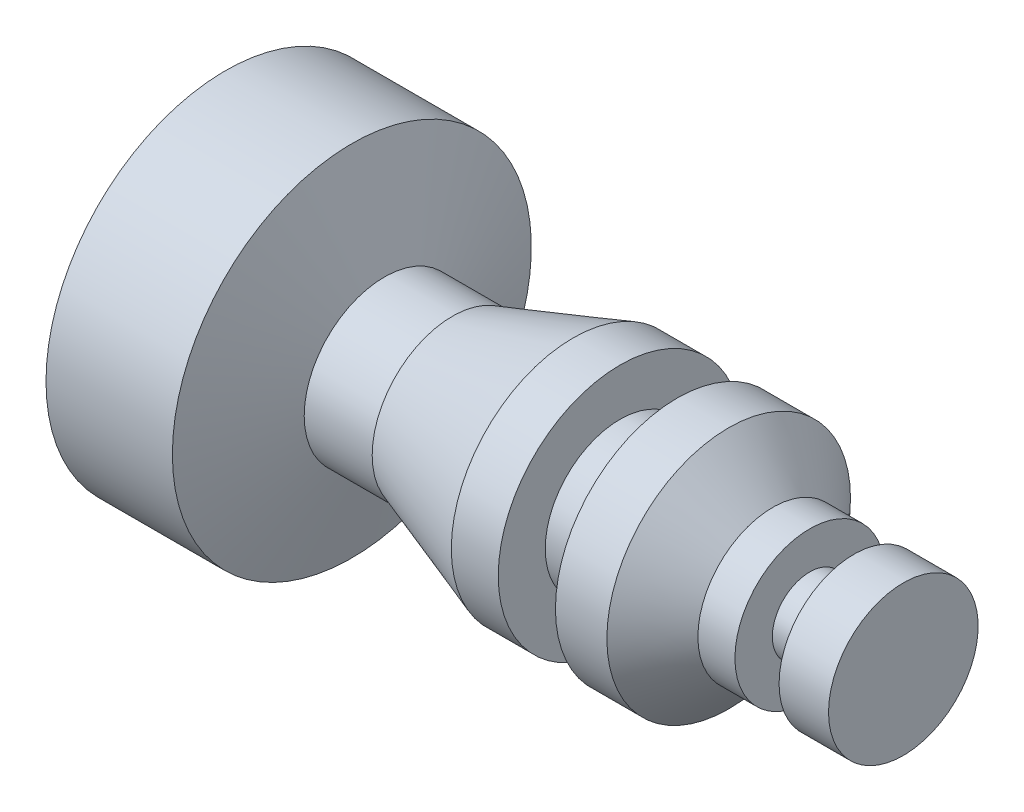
from build123d import *

# Parameters (mm, degrees)
SCALE1_SCALE = 0.2


with BuildPart() as part:
    # Sketch1 → Revolve1 (revolve)
    with BuildSketch(Plane.XY, mode=Mode.PRIVATE) as revolve1_sk:
        Polygon((0, 0), (0, 172.699726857), (121.608545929, 172.699726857), (152.963270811, 77.210337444), (218.388332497, 77.210337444), (334.524076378, 117.212649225), (379.687976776, 117.212649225), (379.687976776, 71.982571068), (434.713962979, 71.982571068), (434.713962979, 117.212649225), (484.210146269, 117.212649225), (526.556756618, 71.982571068), (562.189955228, 71.982571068), (562.189955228, 35.991285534), (604.681952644, 35.991285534), (604.681952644, 71.982571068), (652.27298975, 71.982571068), (652.27298975, 0), align=None)
    revolve(revolve1_sk.sketch.rotate(Axis((0, 0, 0), (1, 0, 0)), 90), axis=Axis((0, 0, 0), (1, 0, 0)))


with BuildPart() as part_1:
    # Scale1: scaled about (223.357652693, 0, 0)
    add(part.part.scale(SCALE1_SCALE).moved(Location((178.686122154, 0, 0))))


solid = part_1.part
